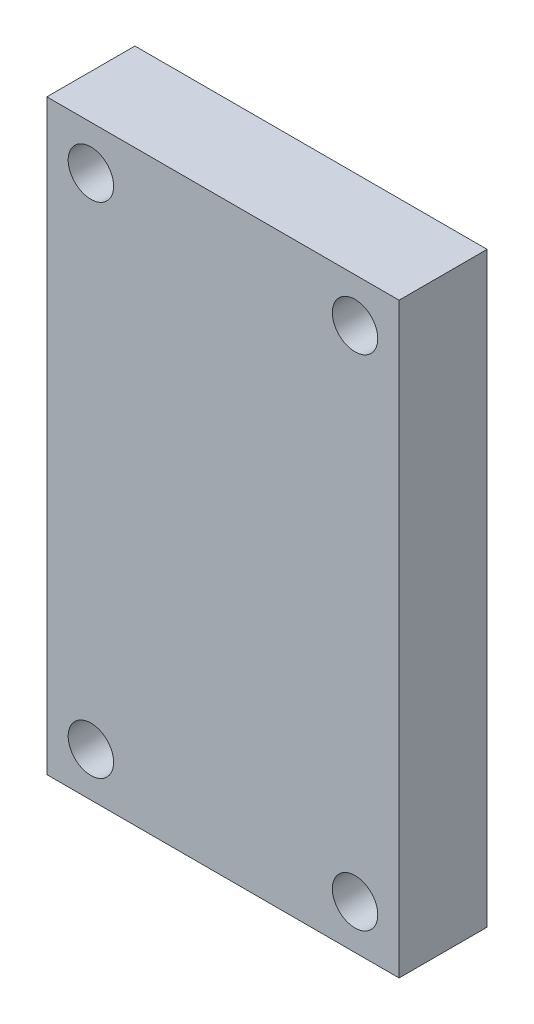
from build123d import *

# Parameters (mm, degrees)
SKETCH1_W                    = 38.1
SKETCH1_H                    = 63.5
BOSS_EXTRUDE1_DEPTH          = 9.525
F_10_0_1935_DIAMETER_HOLE1_D = 4.9149


with BuildPart() as part:
    # Sketch1 → Boss-Extrude1 (new body)
    with BuildSketch(Plane.XY):
        with Locations((19.05, 31.75)):
            Rectangle(SKETCH1_W, SKETCH1_H)
    extrude(amount=BOSS_EXTRUDE1_DEPTH)

    # 10 _0.1935_ Diameter Hole1 (through all)
    with Locations(Plane.XY.offset(9.525)):
        with Locations((4.7625, 58.7375), (33.3375, 58.7375), (4.7625, 4.7625), (33.3375, 4.7625)):
            Hole(F_10_0_1935_DIAMETER_HOLE1_D / 2)


solid = part.part
